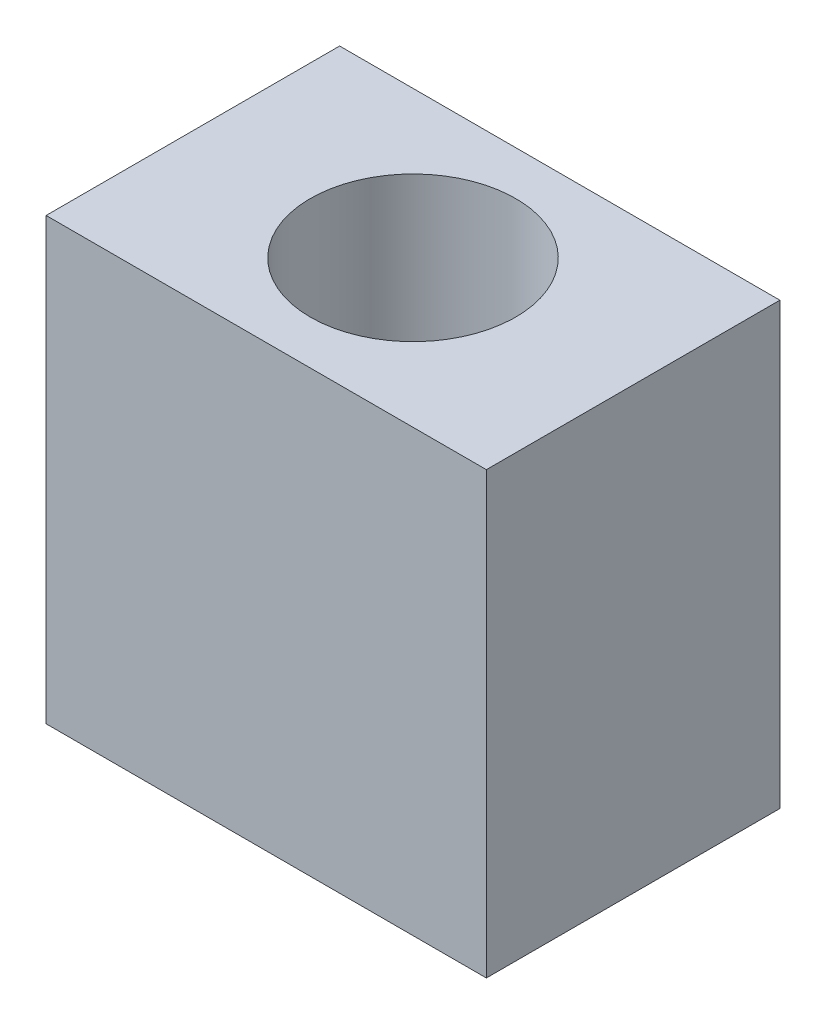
from build123d import *

# Parameters (mm, degrees)
ESQUISSE2_W            = 30
ESQUISSE2_H            = 30
EXTRUSION1_DEPTH       = 20
TROU_TARAUD_M161_D     = 14
TROU_TARAUD_M161_DEPTH = 38
TROU_TARAUD_M161_TIP   = 4.206024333


with BuildPart() as part:
    # Esquisse2 → Extrusion1 (new body)
    with BuildSketch(Plane.XY):
        with Locations((15, -15)):
            Rectangle(ESQUISSE2_W, ESQUISSE2_H)
    extrude(amount=EXTRUSION1_DEPTH)

    # Trou taraud_ M161
    with Locations(Plane(origin=(0, 0, 0), x_dir=(-1, 0, 0), z_dir=(0, 1, 0))):
        with Locations((-15, 10)):
            Hole(TROU_TARAUD_M161_D / 2, depth=TROU_TARAUD_M161_DEPTH)
            with Locations((0, 0, -(TROU_TARAUD_M161_DEPTH + TROU_TARAUD_M161_TIP / 2))):  # 118° drill point
                Cone(0, TROU_TARAUD_M161_D / 2, TROU_TARAUD_M161_TIP, mode=Mode.SUBTRACT)


solid = part.part
